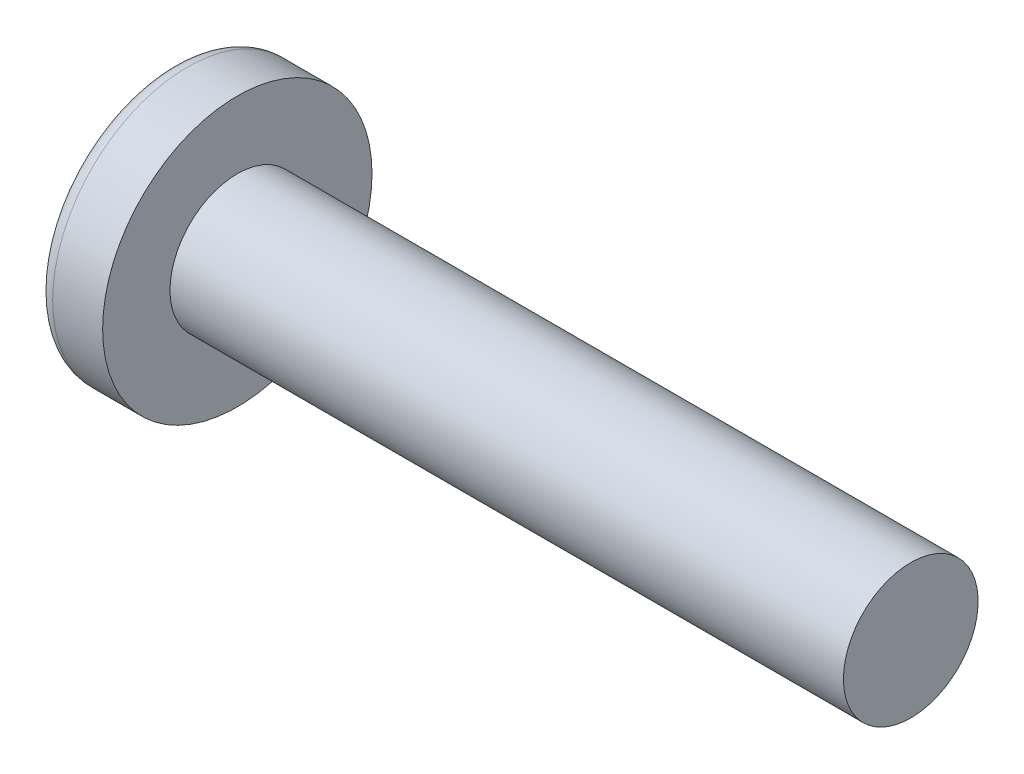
ISO-10303-21;
HEADER;
FILE_DESCRIPTION(('STEP AP214'),'2;1');
FILE_NAME('part.step','',(''),(''),'','','');
FILE_SCHEMA(('AUTOMOTIVE_DESIGN { 1 0 10303 214 1 1 1 1 }'));
ENDSEC;
DATA;
#1=APPLICATION_CONTEXT('core data for automotive mechanical design processes');
#2=APPLICATION_PROTOCOL_DEFINITION('international standard','automotive_design',2000,#1);
#3=PRODUCT_CONTEXT('',#1,'mechanical');
#4=PRODUCT('Part','Part','',(#3));
#5=PRODUCT_RELATED_PRODUCT_CATEGORY('part','',(#4));
#6=PRODUCT_DEFINITION_FORMATION('','',#4);
#7=PRODUCT_DEFINITION_CONTEXT('part definition',#1,'design');
#8=PRODUCT_DEFINITION('design','',#6,#7);
#9=PRODUCT_DEFINITION_SHAPE('','',#8);
#10=(LENGTH_UNIT() NAMED_UNIT(*) SI_UNIT(.MILLI.,.METRE.));
#11=(NAMED_UNIT(*) PLANE_ANGLE_UNIT() SI_UNIT($,.RADIAN.));
#12=(NAMED_UNIT(*) SI_UNIT($,.STERADIAN.) SOLID_ANGLE_UNIT());
#13=UNCERTAINTY_MEASURE_WITH_UNIT(LENGTH_MEASURE(1.E-05),#10,'distance_accuracy_value','');
#14=(GEOMETRIC_REPRESENTATION_CONTEXT(3) GLOBAL_UNCERTAINTY_ASSIGNED_CONTEXT((#13)) GLOBAL_UNIT_ASSIGNED_CONTEXT((#10,
#11,#12)) REPRESENTATION_CONTEXT('',''));
#15=CARTESIAN_POINT('',(0.,0.,0.));
#16=DIRECTION('',(0.,0.,1.));
#17=DIRECTION('',(1.,0.,0.));
#18=AXIS2_PLACEMENT_3D('',#15,#16,#17);
#19=CARTESIAN_POINT('',(6.5,0.,0.));
#20=DIRECTION('',(-1.,0.,0.));
#21=DIRECTION('',(0.,1.,0.));
#22=AXIS2_PLACEMENT_3D('',#19,#20,#21);
#23=SPHERICAL_SURFACE('',#22,6.5);
#24=CARTESIAN_POINT('',(1.22696010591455,0.,0.));
#25=DIRECTION('',(-1.,0.,0.));
#26=DIRECTION('',(0.,0.,1.));
#27=AXIS2_PLACEMENT_3D('',#24,#25,#26);
#28=CIRCLE('',#27,3.80066445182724);
#29=CARTESIAN_POINT('',(1.22696010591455,0.,3.80066445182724));
#30=VERTEX_POINT('',#29);
#31=EDGE_CURVE('E153',#30,#30,#28,.T.);
#32=ORIENTED_EDGE('',*,*,#31,.T.);
#33=EDGE_LOOP('',(#32));
#34=FACE_BOUND('',#33,.T.);
#35=CARTESIAN_POINT('',(6.48571960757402,-0.15048155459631,0.));
#36=DIRECTION('',(-0.0944735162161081,-0.995527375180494,0.));
#37=DIRECTION('',(0.995527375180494,-0.0944735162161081,0.));
#38=AXIS2_PLACEMENT_3D('',#35,#36,#37);
#39=CIRCLE('',#38,6.49824217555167);
#40=CARTESIAN_POINT('',(0.314004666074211,0.4352015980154,1.94783502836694));
#41=VERTEX_POINT('',#40);
#42=CARTESIAN_POINT('',(0.0329034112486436,0.461877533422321,0.461877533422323));
#43=VERTEX_POINT('',#42);
#44=EDGE_CURVE('E184',#41,#43,#39,.T.);
#45=ORIENTED_EDGE('',*,*,#44,.F.);
#46=CARTESIAN_POINT('',(5.02565375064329,0.,-1.83590765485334));
#47=DIRECTION('',(0.626149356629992,0.,0.779703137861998));
#48=DIRECTION('',(0.779703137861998,0.,-0.626149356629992));
#49=AXIS2_PLACEMENT_3D('',#46,#47,#48);
#50=CIRCLE('',#49,6.05852673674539);
#51=CARTESIAN_POINT('',(0.314004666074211,-0.435201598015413,1.94783502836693));
#52=VERTEX_POINT('',#51);
#53=EDGE_CURVE('E149',#41,#52,#50,.T.);
#54=ORIENTED_EDGE('',*,*,#53,.T.);
#55=CARTESIAN_POINT('',(6.48571960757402,0.15048155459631,0.));
#56=DIRECTION('',(-0.0944735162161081,0.995527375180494,0.));
#57=DIRECTION('',(-0.995527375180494,-0.0944735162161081,0.));
#58=AXIS2_PLACEMENT_3D('',#55,#56,#57);
#59=CIRCLE('',#58,6.49824217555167);
#60=CARTESIAN_POINT('',(0.0329034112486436,-0.461877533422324,0.461877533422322));
#61=VERTEX_POINT('',#60);
#62=EDGE_CURVE('E105',#61,#52,#59,.T.);
#63=ORIENTED_EDGE('',*,*,#62,.F.);
#64=CARTESIAN_POINT('',(6.48571960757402,0.,-0.15048155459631));
#65=DIRECTION('',(-0.0944735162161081,0.,-0.995527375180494));
#66=DIRECTION('',(-0.995527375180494,0.,0.0944735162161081));
#67=AXIS2_PLACEMENT_3D('',#64,#65,#66);
#68=CIRCLE('',#67,6.49824217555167);
#69=CARTESIAN_POINT('',(0.31400466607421,-1.94783502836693,0.435201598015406));
#70=VERTEX_POINT('',#69);
#71=EDGE_CURVE('E130',#70,#61,#68,.T.);
#72=ORIENTED_EDGE('',*,*,#71,.F.);
#73=CARTESIAN_POINT('',(5.02565375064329,1.83590765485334,0.));
#74=DIRECTION('',(0.626149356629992,-0.779703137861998,0.));
#75=DIRECTION('',(0.779703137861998,0.626149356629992,0.));
#76=AXIS2_PLACEMENT_3D('',#73,#74,#75);
#77=CIRCLE('',#76,6.05852673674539);
#78=CARTESIAN_POINT('',(0.31400466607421,-1.94783502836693,-0.435201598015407));
#79=VERTEX_POINT('',#78);
#80=EDGE_CURVE('E138',#70,#79,#77,.T.);
#81=ORIENTED_EDGE('',*,*,#80,.T.);
#82=CARTESIAN_POINT('',(6.48571960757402,0.,0.15048155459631));
#83=DIRECTION('',(-0.0944735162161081,0.,0.995527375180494));
#84=DIRECTION('',(0.995527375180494,0.,0.0944735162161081));
#85=AXIS2_PLACEMENT_3D('',#82,#83,#84);
#86=CIRCLE('',#85,6.49824217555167);
#87=CARTESIAN_POINT('',(0.0329034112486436,-0.461877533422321,-0.461877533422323));
#88=VERTEX_POINT('',#87);
#89=EDGE_CURVE('E48',#88,#79,#86,.T.);
#90=ORIENTED_EDGE('',*,*,#89,.F.);
#91=CARTESIAN_POINT('',(0.314004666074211,-0.435201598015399,-1.94783502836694));
#92=VERTEX_POINT('',#91);
#93=EDGE_CURVE('E191',#92,#88,#59,.T.);
#94=ORIENTED_EDGE('',*,*,#93,.F.);
#95=CARTESIAN_POINT('',(5.02565375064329,0.,1.83590765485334));
#96=DIRECTION('',(0.626149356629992,0.,-0.779703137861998));
#97=DIRECTION('',(-0.779703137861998,0.,-0.626149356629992));
#98=AXIS2_PLACEMENT_3D('',#95,#96,#97);
#99=CIRCLE('',#98,6.05852673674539);
#100=CARTESIAN_POINT('',(0.314004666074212,0.435201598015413,-1.94783502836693));
#101=VERTEX_POINT('',#100);
#102=EDGE_CURVE('E131',#92,#101,#99,.T.);
#103=ORIENTED_EDGE('',*,*,#102,.T.);
#104=CARTESIAN_POINT('',(0.0329034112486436,0.461877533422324,-0.461877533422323));
#105=VERTEX_POINT('',#104);
#106=EDGE_CURVE('E179',#105,#101,#39,.T.);
#107=ORIENTED_EDGE('',*,*,#106,.F.);
#108=CARTESIAN_POINT('',(0.314004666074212,1.94783502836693,-0.435201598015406));
#109=VERTEX_POINT('',#108);
#110=EDGE_CURVE('E41',#109,#105,#86,.T.);
#111=ORIENTED_EDGE('',*,*,#110,.F.);
#112=CARTESIAN_POINT('',(5.02565375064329,-1.83590765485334,0.));
#113=DIRECTION('',(0.626149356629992,0.779703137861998,0.));
#114=DIRECTION('',(-0.779703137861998,0.626149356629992,0.));
#115=AXIS2_PLACEMENT_3D('',#112,#113,#114);
#116=CIRCLE('',#115,6.05852673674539);
#117=CARTESIAN_POINT('',(0.314004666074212,1.94783502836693,0.435201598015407));
#118=VERTEX_POINT('',#117);
#119=EDGE_CURVE('E11',#109,#118,#116,.T.);
#120=ORIENTED_EDGE('',*,*,#119,.T.);
#121=EDGE_CURVE('E167',#43,#118,#68,.T.);
#122=ORIENTED_EDGE('',*,*,#121,.F.);
#123=EDGE_LOOP('',(#45,#54,#63,#72,#81,#90,#94,#103,#107,#111,#120,#122));
#124=FACE_BOUND('',#123,.T.);
#125=ADVANCED_FACE('F33',(#34,#124),#23,.T.);
#126=CARTESIAN_POINT('',(2.73951715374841,0.,-0.20502541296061));
#127=DIRECTION('',(-0.0944735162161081,0.,0.995527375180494));
#128=DIRECTION('',(0.995527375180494,0.,0.0944735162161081));
#129=AXIS2_PLACEMENT_3D('',#126,#127,#128);
#130=PLANE('',#129);
#131=ORIENTED_EDGE('',*,*,#110,.T.);
#132=DIRECTION('',(0.991114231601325,-0.0940547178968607,0.0940547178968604));
#133=VECTOR('',#132,1.);
#134=CARTESIAN_POINT('',(2.75862941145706,0.203211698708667,-0.203211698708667));
#135=LINE('',#134,#133);
#136=CARTESIAN_POINT('',(2.45,0.232500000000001,-0.232499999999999));
#137=VERTEX_POINT('',#136);
#138=EDGE_CURVE('E173',#105,#137,#135,.T.);
#139=ORIENTED_EDGE('',*,*,#138,.T.);
#140=DIRECTION('',(0.777577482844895,-0.624442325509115,0.0737905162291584));
#141=VECTOR('',#140,1.);
#142=CARTESIAN_POINT('',(0.,2.2,-0.465));
#143=LINE('',#142,#141);
#144=EDGE_CURVE('E154',#109,#137,#143,.T.);
#145=ORIENTED_EDGE('',*,*,#144,.F.);
#146=EDGE_LOOP('',(#131,#139,#145));
#147=FACE_BOUND('',#146,.T.);
#148=ADVANCED_FACE('F172',(#147),#130,.T.);
#149=DIRECTION('',(0.777577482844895,0.624442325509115,0.0737905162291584));
#150=VECTOR('',#149,1.);
#151=CARTESIAN_POINT('',(0.,-2.2,-0.465));
#152=LINE('',#151,#150);
#153=CARTESIAN_POINT('',(2.45,-0.2325,-0.2325));
#154=VERTEX_POINT('',#153);
#155=EDGE_CURVE('E139',#79,#154,#152,.T.);
#156=ORIENTED_EDGE('',*,*,#155,.T.);
#157=DIRECTION('',(-0.991114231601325,-0.09405471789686,-0.0940547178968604));
#158=VECTOR('',#157,1.);
#159=CARTESIAN_POINT('',(2.75862941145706,-0.203211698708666,-0.203211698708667));
#160=LINE('',#159,#158);
#161=EDGE_CURVE('E194',#154,#88,#160,.T.);
#162=ORIENTED_EDGE('',*,*,#161,.T.);
#163=ORIENTED_EDGE('',*,*,#89,.T.);
#164=EDGE_LOOP('',(#156,#162,#163));
#165=FACE_BOUND('',#164,.T.);
#166=ADVANCED_FACE('F209',(#165),#130,.T.);
#167=CARTESIAN_POINT('',(2.73951715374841,0.,0.20502541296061));
#168=DIRECTION('',(-0.0944735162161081,0.,-0.995527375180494));
#169=DIRECTION('',(-0.995527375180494,0.,0.0944735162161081));
#170=AXIS2_PLACEMENT_3D('',#167,#168,#169);
#171=PLANE('',#170);
#172=DIRECTION('',(0.777577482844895,-0.624442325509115,-0.0737905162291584));
#173=VECTOR('',#172,1.);
#174=CARTESIAN_POINT('',(0.,2.2,0.465));
#175=LINE('',#174,#173);
#176=CARTESIAN_POINT('',(2.45,0.2325,0.2325));
#177=VERTEX_POINT('',#176);
#178=EDGE_CURVE('E210',#118,#177,#175,.T.);
#179=ORIENTED_EDGE('',*,*,#178,.T.);
#180=DIRECTION('',(-0.991114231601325,0.0940547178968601,0.0940547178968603));
#181=VECTOR('',#180,1.);
#182=CARTESIAN_POINT('',(2.75862941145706,0.203211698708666,0.203211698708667));
#183=LINE('',#182,#181);
#184=EDGE_CURVE('E188',#177,#43,#183,.T.);
#185=ORIENTED_EDGE('',*,*,#184,.T.);
#186=ORIENTED_EDGE('',*,*,#121,.T.);
#187=EDGE_LOOP('',(#179,#185,#186));
#188=FACE_BOUND('',#187,.T.);
#189=ADVANCED_FACE('F214',(#188),#171,.T.);
#190=ORIENTED_EDGE('',*,*,#71,.T.);
#191=DIRECTION('',(0.991114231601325,0.0940547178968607,-0.0940547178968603));
#192=VECTOR('',#191,1.);
#193=CARTESIAN_POINT('',(2.75862941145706,-0.203211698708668,0.203211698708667));
#194=LINE('',#193,#192);
#195=CARTESIAN_POINT('',(2.45,-0.232500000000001,0.232499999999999));
#196=VERTEX_POINT('',#195);
#197=EDGE_CURVE('E103',#61,#196,#194,.T.);
#198=ORIENTED_EDGE('',*,*,#197,.T.);
#199=DIRECTION('',(0.777577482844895,0.624442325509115,-0.0737905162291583));
#200=VECTOR('',#199,1.);
#201=CARTESIAN_POINT('',(0.,-2.2,0.465));
#202=LINE('',#201,#200);
#203=EDGE_CURVE('E128',#70,#196,#202,.T.);
#204=ORIENTED_EDGE('',*,*,#203,.F.);
#205=EDGE_LOOP('',(#190,#198,#204));
#206=FACE_BOUND('',#205,.T.);
#207=ADVANCED_FACE('F127',(#206),#171,.T.);
#208=CARTESIAN_POINT('',(-25.4,0.,0.));
#209=DIRECTION('',(-1.,0.,0.));
#210=DIRECTION('',(0.,0.,1.));
#211=AXIS2_PLACEMENT_3D('',#208,#209,#210);
#212=CYLINDRICAL_SURFACE('',#211,2.);
#213=CARTESIAN_POINT('',(23.1,0.,0.));
#214=DIRECTION('',(-1.,0.,0.));
#215=DIRECTION('',(0.,0.,1.));
#216=AXIS2_PLACEMENT_3D('',#213,#214,#215);
#217=CIRCLE('',#216,2.);
#218=CARTESIAN_POINT('',(23.1,0.,2.));
#219=VERTEX_POINT('',#218);
#220=EDGE_CURVE('E150',#219,#219,#217,.T.);
#221=ORIENTED_EDGE('',*,*,#220,.T.);
#222=EDGE_LOOP('',(#221));
#223=FACE_BOUND('',#222,.T.);
#224=CARTESIAN_POINT('',(3.1,0.,0.));
#225=DIRECTION('',(-1.,0.,0.));
#226=DIRECTION('',(0.,0.,1.));
#227=AXIS2_PLACEMENT_3D('',#224,#225,#226);
#228=CIRCLE('',#227,2.);
#229=CARTESIAN_POINT('',(3.1,0.,2.));
#230=VERTEX_POINT('',#229);
#231=EDGE_CURVE('E163',#230,#230,#228,.T.);
#232=ORIENTED_EDGE('',*,*,#231,.F.);
#233=EDGE_LOOP('',(#232));
#234=FACE_BOUND('',#233,.T.);
#235=ADVANCED_FACE('F35',(#223,#234),#212,.T.);
#236=CARTESIAN_POINT('',(3.1,2.,0.));
#237=DIRECTION('',(-1.,0.,0.));
#238=DIRECTION('',(0.,0.,1.));
#239=AXIS2_PLACEMENT_3D('',#236,#237,#238);
#240=PLANE('',#239);
#241=CARTESIAN_POINT('',(3.1,0.,0.));
#242=DIRECTION('',(-1.,0.,0.));
#243=DIRECTION('',(0.,0.,1.));
#244=AXIS2_PLACEMENT_3D('',#241,#242,#243);
#245=CIRCLE('',#244,4.);
#246=CARTESIAN_POINT('',(3.1,0.,4.));
#247=VERTEX_POINT('',#246);
#248=EDGE_CURVE('E160',#247,#247,#245,.T.);
#249=ORIENTED_EDGE('',*,*,#248,.F.);
#250=EDGE_LOOP('',(#249));
#251=FACE_BOUND('',#250,.T.);
#252=ORIENTED_EDGE('',*,*,#231,.T.);
#253=EDGE_LOOP('',(#252));
#254=FACE_BOUND('',#253,.T.);
#255=ADVANCED_FACE('F242',(#251,#254),#240,.F.);
#256=CARTESIAN_POINT('',(-25.4,0.,0.));
#257=DIRECTION('',(-1.,0.,0.));
#258=DIRECTION('',(0.,0.,1.));
#259=AXIS2_PLACEMENT_3D('',#256,#257,#258);
#260=CYLINDRICAL_SURFACE('',#259,4.);
#261=ORIENTED_EDGE('',*,*,#248,.T.);
#262=EDGE_LOOP('',(#261));
#263=FACE_BOUND('',#262,.T.);
#264=CARTESIAN_POINT('',(1.61635382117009,0.,0.));
#265=DIRECTION('',(-1.,0.,0.));
#266=DIRECTION('',(0.,0.,1.));
#267=AXIS2_PLACEMENT_3D('',#264,#265,#266);
#268=CIRCLE('',#267,4.);
#269=CARTESIAN_POINT('',(1.61635382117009,0.,4.));
#270=VERTEX_POINT('',#269);
#271=EDGE_CURVE('E157',#270,#270,#268,.T.);
#272=ORIENTED_EDGE('',*,*,#271,.F.);
#273=EDGE_LOOP('',(#272));
#274=FACE_BOUND('',#273,.T.);
#275=ADVANCED_FACE('F239',(#263,#274),#260,.T.);
#276=CARTESIAN_POINT('',(1.61635382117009,0.,0.));
#277=DIRECTION('',(-1.,0.,0.));
#278=DIRECTION('',(0.,0.,1.));
#279=AXIS2_PLACEMENT_3D('',#276,#277,#278);
#280=TOROIDAL_SURFACE('',#279,3.52,0.48);
#281=ORIENTED_EDGE('',*,*,#271,.T.);
#282=EDGE_LOOP('',(#281));
#283=FACE_BOUND('',#282,.T.);
#284=ORIENTED_EDGE('',*,*,#31,.F.);
#285=EDGE_LOOP('',(#284));
#286=FACE_BOUND('',#285,.T.);
#287=ADVANCED_FACE('F236',(#283,#286),#280,.T.);
#288=CARTESIAN_POINT('',(23.1,2.,0.));
#289=DIRECTION('',(1.,0.,0.));
#290=DIRECTION('',(0.,0.,-1.));
#291=AXIS2_PLACEMENT_3D('',#288,#289,#290);
#292=PLANE('',#291);
#293=ORIENTED_EDGE('',*,*,#220,.F.);
#294=EDGE_LOOP('',(#293));
#295=FACE_BOUND('',#294,.T.);
#296=ADVANCED_FACE('F234',(#295),#292,.T.);
#297=CARTESIAN_POINT('',(2.45,0.2325,0.2325));
#298=DIRECTION('',(0.626149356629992,0.779703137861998,0.));
#299=DIRECTION('',(-0.779703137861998,0.626149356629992,0.));
#300=AXIS2_PLACEMENT_3D('',#297,#298,#299);
#301=PLANE('',#300);
#302=ORIENTED_EDGE('',*,*,#144,.T.);
#303=DIRECTION('',(0.,0.,-1.));
#304=VECTOR('',#303,1.);
#305=CARTESIAN_POINT('',(2.45,0.2325,0.2325));
#306=LINE('',#305,#304);
#307=EDGE_CURVE('E121',#177,#137,#306,.T.);
#308=ORIENTED_EDGE('',*,*,#307,.F.);
#309=ORIENTED_EDGE('',*,*,#178,.F.);
#310=ORIENTED_EDGE('',*,*,#119,.F.);
#311=EDGE_LOOP('',(#302,#308,#309,#310));
#312=FACE_BOUND('',#311,.T.);
#313=ADVANCED_FACE('F213',(#312),#301,.F.);
#314=CARTESIAN_POINT('',(2.45,-0.2325,-0.2325));
#315=DIRECTION('',(0.626149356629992,-0.779703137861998,0.));
#316=DIRECTION('',(0.779703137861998,0.626149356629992,0.));
#317=AXIS2_PLACEMENT_3D('',#314,#315,#316);
#318=PLANE('',#317);
#319=ORIENTED_EDGE('',*,*,#203,.T.);
#320=DIRECTION('',(0.,0.,1.));
#321=VECTOR('',#320,1.);
#322=CARTESIAN_POINT('',(2.45,-0.2325,-0.2325));
#323=LINE('',#322,#321);
#324=EDGE_CURVE('E120',#154,#196,#323,.T.);
#325=ORIENTED_EDGE('',*,*,#324,.F.);
#326=ORIENTED_EDGE('',*,*,#155,.F.);
#327=ORIENTED_EDGE('',*,*,#80,.F.);
#328=EDGE_LOOP('',(#319,#325,#326,#327));
#329=FACE_BOUND('',#328,.T.);
#330=ADVANCED_FACE('F135',(#329),#318,.F.);
#331=CARTESIAN_POINT('',(2.45,0.2325,-0.2325));
#332=DIRECTION('',(-1.,0.,0.));
#333=DIRECTION('',(0.,0.,1.));
#334=AXIS2_PLACEMENT_3D('',#331,#332,#333);
#335=PLANE('',#334);
#336=DIRECTION('',(0.,1.,0.));
#337=VECTOR('',#336,1.);
#338=CARTESIAN_POINT('',(2.45,-0.2325,-0.2325));
#339=LINE('',#338,#337);
#340=EDGE_CURVE('E143',#154,#137,#339,.T.);
#341=ORIENTED_EDGE('',*,*,#340,.F.);
#342=ORIENTED_EDGE('',*,*,#324,.T.);
#343=DIRECTION('',(0.,-1.,0.));
#344=VECTOR('',#343,1.);
#345=CARTESIAN_POINT('',(2.45,0.2325,0.2325));
#346=LINE('',#345,#344);
#347=EDGE_CURVE('E112',#177,#196,#346,.T.);
#348=ORIENTED_EDGE('',*,*,#347,.F.);
#349=ORIENTED_EDGE('',*,*,#307,.T.);
#350=EDGE_LOOP('',(#341,#342,#348,#349));
#351=FACE_BOUND('',#350,.T.);
#352=ADVANCED_FACE('F141',(#351),#335,.T.);
#353=CARTESIAN_POINT('',(2.45,0.232500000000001,-0.232499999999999));
#354=DIRECTION('',(0.626149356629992,0.,-0.779703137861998));
#355=DIRECTION('',(0.779703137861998,0.,0.626149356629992));
#356=AXIS2_PLACEMENT_3D('',#353,#354,#355);
#357=PLANE('',#356);
#358=DIRECTION('',(0.777577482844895,0.0737905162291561,0.624442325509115));
#359=VECTOR('',#358,1.);
#360=CARTESIAN_POINT('',(0.,-0.464999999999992,-2.2));
#361=LINE('',#360,#359);
#362=EDGE_CURVE('E199',#92,#154,#361,.T.);
#363=ORIENTED_EDGE('',*,*,#362,.T.);
#364=ORIENTED_EDGE('',*,*,#340,.T.);
#365=DIRECTION('',(0.777577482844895,-0.0737905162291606,0.624442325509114));
#366=VECTOR('',#365,1.);
#367=CARTESIAN_POINT('',(0.,0.465000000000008,-2.2));
#368=LINE('',#367,#366);
#369=EDGE_CURVE('E109',#101,#137,#368,.T.);
#370=ORIENTED_EDGE('',*,*,#369,.F.);
#371=ORIENTED_EDGE('',*,*,#102,.F.);
#372=EDGE_LOOP('',(#363,#364,#370,#371));
#373=FACE_BOUND('',#372,.T.);
#374=ADVANCED_FACE('F204',(#373),#357,.F.);
#375=CARTESIAN_POINT('',(2.73951715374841,-0.20502541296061,0.));
#376=DIRECTION('',(-0.0944735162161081,0.995527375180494,0.));
#377=DIRECTION('',(-0.995527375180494,-0.0944735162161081,0.));
#378=AXIS2_PLACEMENT_3D('',#375,#376,#377);
#379=PLANE('',#378);
#380=ORIENTED_EDGE('',*,*,#93,.T.);
#381=ORIENTED_EDGE('',*,*,#161,.F.);
#382=ORIENTED_EDGE('',*,*,#362,.F.);
#383=EDGE_LOOP('',(#380,#381,#382));
#384=FACE_BOUND('',#383,.T.);
#385=ADVANCED_FACE('F208',(#384),#379,.T.);
#386=CARTESIAN_POINT('',(2.73951715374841,0.20502541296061,0.));
#387=DIRECTION('',(-0.0944735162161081,-0.995527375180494,0.));
#388=DIRECTION('',(0.995527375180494,-0.0944735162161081,0.));
#389=AXIS2_PLACEMENT_3D('',#386,#387,#388);
#390=PLANE('',#389);
#391=ORIENTED_EDGE('',*,*,#106,.T.);
#392=ORIENTED_EDGE('',*,*,#369,.T.);
#393=ORIENTED_EDGE('',*,*,#138,.F.);
#394=EDGE_LOOP('',(#391,#392,#393));
#395=FACE_BOUND('',#394,.T.);
#396=ADVANCED_FACE('F202',(#395),#390,.T.);
#397=CARTESIAN_POINT('',(2.45,-0.232500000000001,0.232499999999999));
#398=DIRECTION('',(0.626149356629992,0.,0.779703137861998));
#399=DIRECTION('',(-0.779703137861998,0.,0.626149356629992));
#400=AXIS2_PLACEMENT_3D('',#397,#398,#399);
#401=PLANE('',#400);
#402=DIRECTION('',(0.777577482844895,-0.0737905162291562,-0.624442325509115));
#403=VECTOR('',#402,1.);
#404=CARTESIAN_POINT('',(0.,0.464999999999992,2.2));
#405=LINE('',#404,#403);
#406=EDGE_CURVE('E108',#41,#177,#405,.T.);
#407=ORIENTED_EDGE('',*,*,#406,.T.);
#408=ORIENTED_EDGE('',*,*,#347,.T.);
#409=DIRECTION('',(0.777577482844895,0.0737905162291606,-0.624442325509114));
#410=VECTOR('',#409,1.);
#411=CARTESIAN_POINT('',(0.,-0.465000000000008,2.2));
#412=LINE('',#411,#410);
#413=EDGE_CURVE('E99',#52,#196,#412,.T.);
#414=ORIENTED_EDGE('',*,*,#413,.F.);
#415=ORIENTED_EDGE('',*,*,#53,.F.);
#416=EDGE_LOOP('',(#407,#408,#414,#415));
#417=FACE_BOUND('',#416,.T.);
#418=ADVANCED_FACE('F113',(#417),#401,.F.);
#419=ORIENTED_EDGE('',*,*,#44,.T.);
#420=ORIENTED_EDGE('',*,*,#184,.F.);
#421=ORIENTED_EDGE('',*,*,#406,.F.);
#422=EDGE_LOOP('',(#419,#420,#421));
#423=FACE_BOUND('',#422,.T.);
#424=ADVANCED_FACE('F215',(#423),#390,.T.);
#425=ORIENTED_EDGE('',*,*,#62,.T.);
#426=ORIENTED_EDGE('',*,*,#413,.T.);
#427=ORIENTED_EDGE('',*,*,#197,.F.);
#428=EDGE_LOOP('',(#425,#426,#427));
#429=FACE_BOUND('',#428,.T.);
#430=ADVANCED_FACE('F101',(#429),#379,.T.);
#431=CLOSED_SHELL('',(#125,#148,#166,#189,#207,#235,#255,#275,#287,#296,#313,#330,#352,#374,
#385,#396,#418,#424,#430));
#432=MANIFOLD_SOLID_BREP('B2',#431);
#433=ADVANCED_BREP_SHAPE_REPRESENTATION('',(#18,#432),#14);
#434=SHAPE_DEFINITION_REPRESENTATION(#9,#433);
ENDSEC;
END-ISO-10303-21;
